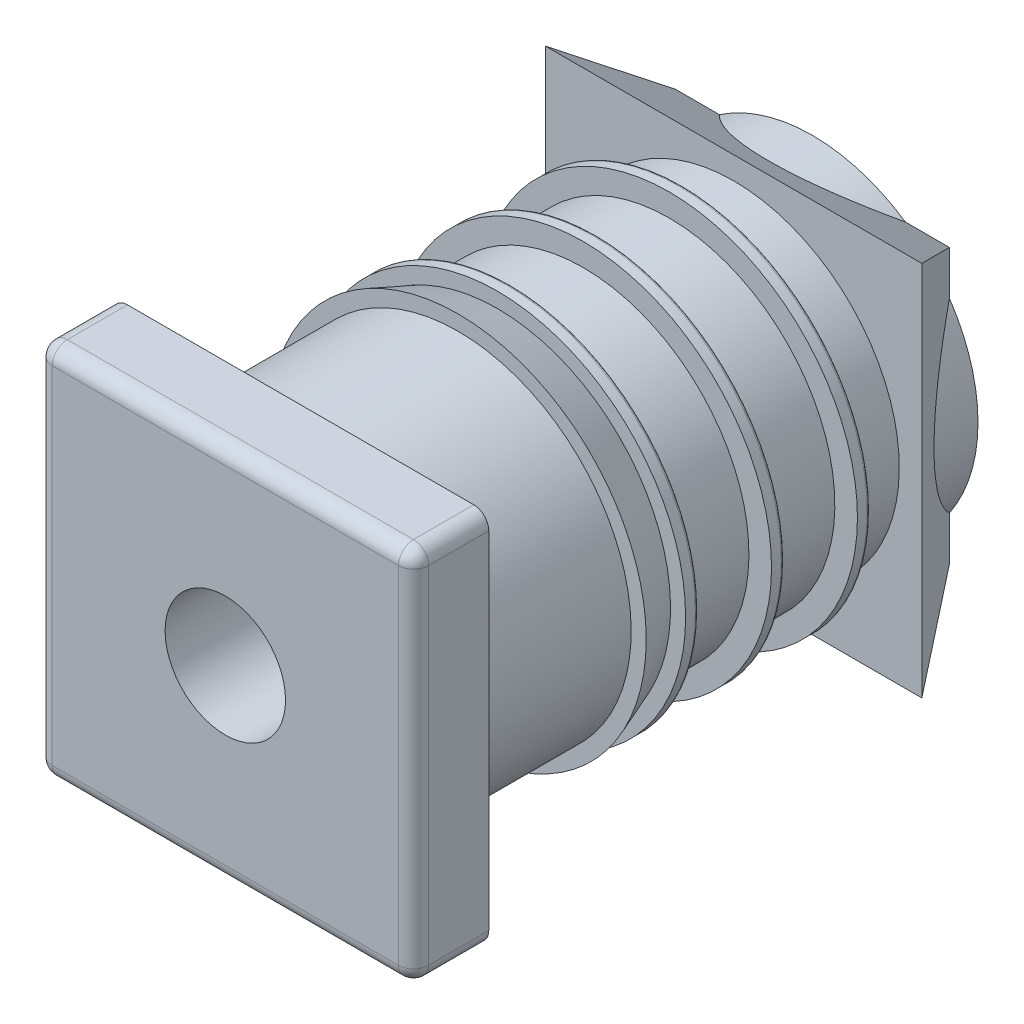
ISO-10303-21;
HEADER;
FILE_DESCRIPTION(('STEP AP214'),'2;1');
FILE_NAME('part.step','',(''),(''),'','','');
FILE_SCHEMA(('AUTOMOTIVE_DESIGN { 1 0 10303 214 1 1 1 1 }'));
ENDSEC;
DATA;
#1=APPLICATION_CONTEXT('core data for automotive mechanical design processes');
#2=APPLICATION_PROTOCOL_DEFINITION('international standard','automotive_design',2000,#1);
#3=PRODUCT_CONTEXT('',#1,'mechanical');
#4=PRODUCT('Part','Part','',(#3));
#5=PRODUCT_RELATED_PRODUCT_CATEGORY('part','',(#4));
#6=PRODUCT_DEFINITION_FORMATION('','',#4);
#7=PRODUCT_DEFINITION_CONTEXT('part definition',#1,'design');
#8=PRODUCT_DEFINITION('design','',#6,#7);
#9=PRODUCT_DEFINITION_SHAPE('','',#8);
#10=(LENGTH_UNIT() NAMED_UNIT(*) SI_UNIT(.MILLI.,.METRE.));
#11=(NAMED_UNIT(*) PLANE_ANGLE_UNIT() SI_UNIT($,.RADIAN.));
#12=(NAMED_UNIT(*) SI_UNIT($,.STERADIAN.) SOLID_ANGLE_UNIT());
#13=UNCERTAINTY_MEASURE_WITH_UNIT(LENGTH_MEASURE(1.E-05),#10,'distance_accuracy_value','');
#14=(GEOMETRIC_REPRESENTATION_CONTEXT(3) GLOBAL_UNCERTAINTY_ASSIGNED_CONTEXT((#13)) GLOBAL_UNIT_ASSIGNED_CONTEXT((#10,
#11,#12)) REPRESENTATION_CONTEXT('',''));
#15=CARTESIAN_POINT('',(0.,0.,0.));
#16=DIRECTION('',(0.,0.,1.));
#17=DIRECTION('',(1.,0.,0.));
#18=AXIS2_PLACEMENT_3D('',#15,#16,#17);
#19=CARTESIAN_POINT('',(-11.65,0.,-19.6340659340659));
#20=DIRECTION('',(0.,0.,-1.));
#21=DIRECTION('',(0.,-1.,0.));
#22=AXIS2_PLACEMENT_3D('',#19,#20,#21);
#23=PLANE('',#22);
#24=CARTESIAN_POINT('',(0.,0.,-19.6340659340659));
#25=DIRECTION('',(0.,0.,1.));
#26=DIRECTION('',(0.,-1.,0.));
#27=AXIS2_PLACEMENT_3D('',#24,#25,#26);
#28=CIRCLE('',#27,12.3);
#29=CARTESIAN_POINT('',(0.,-12.3,-19.6340659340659));
#30=VERTEX_POINT('',#29);
#31=CARTESIAN_POINT('',(0.,12.3,-19.6340659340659));
#32=VERTEX_POINT('',#31);
#33=EDGE_CURVE('E178',#30,#32,#28,.T.);
#34=ORIENTED_EDGE('',*,*,#33,.F.);
#35=CARTESIAN_POINT('',(0.,0.,-19.6340659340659));
#36=DIRECTION('',(0.,0.,1.));
#37=DIRECTION('',(-1.,0.,0.));
#38=AXIS2_PLACEMENT_3D('',#35,#36,#37);
#39=CIRCLE('',#38,12.3);
#40=CARTESIAN_POINT('',(-12.3,0.,-19.6340659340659));
#41=VERTEX_POINT('',#40);
#42=EDGE_CURVE('E171',#41,#30,#39,.T.);
#43=ORIENTED_EDGE('',*,*,#42,.F.);
#44=CARTESIAN_POINT('',(0.,0.,-19.6340659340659));
#45=DIRECTION('',(0.,0.,1.));
#46=DIRECTION('',(0.,1.,0.));
#47=AXIS2_PLACEMENT_3D('',#44,#45,#46);
#48=CIRCLE('',#47,12.3);
#49=EDGE_CURVE('E175',#32,#41,#48,.T.);
#50=ORIENTED_EDGE('',*,*,#49,.F.);
#51=EDGE_LOOP('',(#34,#43,#50));
#52=FACE_BOUND('',#51,.T.);
#53=CARTESIAN_POINT('',(0.,0.,-19.6340659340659));
#54=DIRECTION('',(0.,0.,1.));
#55=DIRECTION('',(0.,1.,0.));
#56=AXIS2_PLACEMENT_3D('',#53,#54,#55);
#57=CIRCLE('',#56,11.);
#58=CARTESIAN_POINT('',(0.,11.,-19.6340659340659));
#59=VERTEX_POINT('',#58);
#60=EDGE_CURVE('E188',#59,#59,#57,.F.);
#61=ORIENTED_EDGE('',*,*,#60,.F.);
#62=EDGE_LOOP('',(#61));
#63=FACE_BOUND('',#62,.T.);
#64=ADVANCED_FACE('F14',(#52,#63),#23,.T.);
#65=CARTESIAN_POINT('',(0.,0.,-22.0626373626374));
#66=DIRECTION('',(0.,0.,1.));
#67=DIRECTION('',(0.,1.,0.));
#68=AXIS2_PLACEMENT_3D('',#65,#66,#67);
#69=CYLINDRICAL_SURFACE('',#68,11.);
#70=CARTESIAN_POINT('',(0.,0.,-24.4912087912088));
#71=DIRECTION('',(0.,0.,1.));
#72=DIRECTION('',(0.,1.,0.));
#73=AXIS2_PLACEMENT_3D('',#70,#71,#72);
#74=CIRCLE('',#73,11.);
#75=CARTESIAN_POINT('',(0.,11.,-24.4912087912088));
#76=VERTEX_POINT('',#75);
#77=EDGE_CURVE('E339',#76,#76,#74,.F.);
#78=ORIENTED_EDGE('',*,*,#77,.F.);
#79=EDGE_LOOP('',(#78));
#80=FACE_BOUND('',#79,.T.);
#81=ORIENTED_EDGE('',*,*,#60,.T.);
#82=EDGE_LOOP('',(#81));
#83=FACE_BOUND('',#82,.T.);
#84=ADVANCED_FACE('F210',(#80,#83),#69,.T.);
#85=CARTESIAN_POINT('',(0.,0.,-19.4340659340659));
#86=DIRECTION('',(0.,0.,-1.));
#87=DIRECTION('',(0.,-1.,0.));
#88=AXIS2_PLACEMENT_3D('',#85,#86,#87);
#89=TOROIDAL_SURFACE('',#88,12.3,0.2);
#90=ORIENTED_EDGE('',*,*,#42,.T.);
#91=ORIENTED_EDGE('',*,*,#33,.T.);
#92=ORIENTED_EDGE('',*,*,#49,.T.);
#93=EDGE_LOOP('',(#90,#91,#92));
#94=FACE_BOUND('',#93,.T.);
#95=CARTESIAN_POINT('',(0.,0.,-19.4340659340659));
#96=DIRECTION('',(0.,0.,1.));
#97=DIRECTION('',(0.,1.,0.));
#98=AXIS2_PLACEMENT_3D('',#95,#96,#97);
#99=CIRCLE('',#98,12.5);
#100=CARTESIAN_POINT('',(0.,12.5,-19.4340659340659));
#101=VERTEX_POINT('',#100);
#102=EDGE_CURVE('E218',#101,#101,#99,.T.);
#103=ORIENTED_EDGE('',*,*,#102,.F.);
#104=EDGE_LOOP('',(#103));
#105=FACE_BOUND('',#104,.T.);
#106=ADVANCED_FACE('F185',(#94,#105),#89,.T.);
#107=CARTESIAN_POINT('',(-11.75,0.,-24.4912087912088));
#108=DIRECTION('',(0.,0.,1.));
#109=DIRECTION('',(0.,1.,0.));
#110=AXIS2_PLACEMENT_3D('',#107,#108,#109);
#111=PLANE('',#110);
#112=ORIENTED_EDGE('',*,*,#77,.T.);
#113=EDGE_LOOP('',(#112));
#114=FACE_BOUND('',#113,.T.);
#115=CARTESIAN_POINT('',(0.,0.,-24.4912087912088));
#116=DIRECTION('',(0.,0.,1.));
#117=DIRECTION('',(0.,1.,0.));
#118=AXIS2_PLACEMENT_3D('',#115,#116,#117);
#119=CIRCLE('',#118,12.5);
#120=CARTESIAN_POINT('',(0.,12.5,-24.4912087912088));
#121=VERTEX_POINT('',#120);
#122=EDGE_CURVE('E336',#121,#121,#119,.F.);
#123=ORIENTED_EDGE('',*,*,#122,.F.);
#124=EDGE_LOOP('',(#123));
#125=FACE_BOUND('',#124,.T.);
#126=ADVANCED_FACE('F209',(#114,#125),#111,.T.);
#127=CARTESIAN_POINT('',(0.,0.,-19.1090659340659));
#128=DIRECTION('',(0.,0.,1.));
#129=DIRECTION('',(0.,1.,0.));
#130=AXIS2_PLACEMENT_3D('',#127,#128,#129);
#131=CYLINDRICAL_SURFACE('',#130,12.5);
#132=ORIENTED_EDGE('',*,*,#102,.T.);
#133=EDGE_LOOP('',(#132));
#134=FACE_BOUND('',#133,.T.);
#135=CARTESIAN_POINT('',(0.,0.,-18.7840659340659));
#136=DIRECTION('',(0.,0.,1.));
#137=DIRECTION('',(0.,1.,0.));
#138=AXIS2_PLACEMENT_3D('',#135,#136,#137);
#139=CIRCLE('',#138,12.5);
#140=CARTESIAN_POINT('',(0.,12.5,-18.7840659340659));
#141=VERTEX_POINT('',#140);
#142=EDGE_CURVE('E333',#141,#141,#139,.T.);
#143=ORIENTED_EDGE('',*,*,#142,.F.);
#144=EDGE_LOOP('',(#143));
#145=FACE_BOUND('',#144,.T.);
#146=ADVANCED_FACE('F482',(#134,#145),#131,.T.);
#147=CARTESIAN_POINT('',(0.,0.,-24.8162087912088));
#148=DIRECTION('',(0.,0.,1.));
#149=DIRECTION('',(0.,1.,0.));
#150=AXIS2_PLACEMENT_3D('',#147,#148,#149);
#151=CYLINDRICAL_SURFACE('',#150,12.5);
#152=ORIENTED_EDGE('',*,*,#122,.T.);
#153=EDGE_LOOP('',(#152));
#154=FACE_BOUND('',#153,.T.);
#155=CARTESIAN_POINT('',(0.,0.,-25.1412087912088));
#156=DIRECTION('',(0.,0.,-1.));
#157=DIRECTION('',(0.,-1.,0.));
#158=AXIS2_PLACEMENT_3D('',#155,#156,#157);
#159=CIRCLE('',#158,12.5);
#160=CARTESIAN_POINT('',(0.,-12.5,-25.1412087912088));
#161=VERTEX_POINT('',#160);
#162=EDGE_CURVE('E332',#161,#161,#159,.T.);
#163=ORIENTED_EDGE('',*,*,#162,.F.);
#164=EDGE_LOOP('',(#163));
#165=FACE_BOUND('',#164,.T.);
#166=ADVANCED_FACE('F480',(#154,#165),#151,.T.);
#167=CARTESIAN_POINT('',(-11.75,0.,-18.7840659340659));
#168=DIRECTION('',(0.,0.,1.));
#169=DIRECTION('',(0.,1.,0.));
#170=AXIS2_PLACEMENT_3D('',#167,#168,#169);
#171=PLANE('',#170);
#172=CARTESIAN_POINT('',(0.,0.,-18.7840659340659));
#173=DIRECTION('',(0.,0.,1.));
#174=DIRECTION('',(0.,1.,0.));
#175=AXIS2_PLACEMENT_3D('',#172,#173,#174);
#176=CIRCLE('',#175,11.);
#177=CARTESIAN_POINT('',(0.,11.,-18.7840659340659));
#178=VERTEX_POINT('',#177);
#179=EDGE_CURVE('E328',#178,#178,#176,.T.);
#180=ORIENTED_EDGE('',*,*,#179,.F.);
#181=EDGE_LOOP('',(#180));
#182=FACE_BOUND('',#181,.T.);
#183=ORIENTED_EDGE('',*,*,#142,.T.);
#184=EDGE_LOOP('',(#183));
#185=FACE_BOUND('',#184,.T.);
#186=ADVANCED_FACE('F460',(#182,#185),#171,.T.);
#187=CARTESIAN_POINT('',(0.,0.,-25.1412087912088));
#188=DIRECTION('',(0.,0.,-1.));
#189=DIRECTION('',(0.,-1.,0.));
#190=AXIS2_PLACEMENT_3D('',#187,#188,#189);
#191=TOROIDAL_SURFACE('',#190,12.3,0.2);
#192=ORIENTED_EDGE('',*,*,#162,.T.);
#193=EDGE_LOOP('',(#192));
#194=FACE_BOUND('',#193,.T.);
#195=CARTESIAN_POINT('',(0.,0.,-25.3412087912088));
#196=DIRECTION('',(0.,0.,1.));
#197=DIRECTION('',(0.,1.,0.));
#198=AXIS2_PLACEMENT_3D('',#195,#196,#197);
#199=CIRCLE('',#198,12.3);
#200=CARTESIAN_POINT('',(-12.3,0.,-25.3412087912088));
#201=VERTEX_POINT('',#200);
#202=CARTESIAN_POINT('',(0.,12.3,-25.3412087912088));
#203=VERTEX_POINT('',#202);
#204=EDGE_CURVE('E331',#201,#203,#199,.F.);
#205=ORIENTED_EDGE('',*,*,#204,.F.);
#206=CARTESIAN_POINT('',(0.,0.,-25.3412087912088));
#207=DIRECTION('',(0.,0.,1.));
#208=DIRECTION('',(-1.,0.,0.));
#209=AXIS2_PLACEMENT_3D('',#206,#207,#208);
#210=CIRCLE('',#209,12.3);
#211=CARTESIAN_POINT('',(0.,-12.3,-25.3412087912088));
#212=VERTEX_POINT('',#211);
#213=EDGE_CURVE('E327',#212,#201,#210,.F.);
#214=ORIENTED_EDGE('',*,*,#213,.F.);
#215=CARTESIAN_POINT('',(0.,0.,-25.3412087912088));
#216=DIRECTION('',(0.,0.,1.));
#217=DIRECTION('',(0.,-1.,0.));
#218=AXIS2_PLACEMENT_3D('',#215,#216,#217);
#219=CIRCLE('',#218,12.3);
#220=EDGE_CURVE('E434',#203,#212,#219,.F.);
#221=ORIENTED_EDGE('',*,*,#220,.F.);
#222=EDGE_LOOP('',(#205,#214,#221));
#223=FACE_BOUND('',#222,.T.);
#224=ADVANCED_FACE('F455',(#194,#223),#191,.T.);
#225=CARTESIAN_POINT('',(0.,0.,-16.3554945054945));
#226=DIRECTION('',(0.,0.,1.));
#227=DIRECTION('',(0.,1.,0.));
#228=AXIS2_PLACEMENT_3D('',#225,#226,#227);
#229=CYLINDRICAL_SURFACE('',#228,11.);
#230=ORIENTED_EDGE('',*,*,#179,.T.);
#231=EDGE_LOOP('',(#230));
#232=FACE_BOUND('',#231,.T.);
#233=CARTESIAN_POINT('',(0.,0.,-13.9269230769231));
#234=DIRECTION('',(0.,0.,1.));
#235=DIRECTION('',(0.,1.,0.));
#236=AXIS2_PLACEMENT_3D('',#233,#234,#235);
#237=CIRCLE('',#236,11.);
#238=CARTESIAN_POINT('',(0.,11.,-13.9269230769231));
#239=VERTEX_POINT('',#238);
#240=EDGE_CURVE('E324',#239,#239,#237,.T.);
#241=ORIENTED_EDGE('',*,*,#240,.F.);
#242=EDGE_LOOP('',(#241));
#243=FACE_BOUND('',#242,.T.);
#244=ADVANCED_FACE('F459',(#232,#243),#229,.T.);
#245=CARTESIAN_POINT('',(-11.65,0.,-25.3412087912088));
#246=DIRECTION('',(0.,0.,-1.));
#247=DIRECTION('',(0.,-1.,0.));
#248=AXIS2_PLACEMENT_3D('',#245,#246,#247);
#249=PLANE('',#248);
#250=ORIENTED_EDGE('',*,*,#220,.T.);
#251=ORIENTED_EDGE('',*,*,#213,.T.);
#252=ORIENTED_EDGE('',*,*,#204,.T.);
#253=EDGE_LOOP('',(#250,#251,#252));
#254=FACE_BOUND('',#253,.T.);
#255=CARTESIAN_POINT('',(0.,0.,-25.3412087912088));
#256=DIRECTION('',(0.,0.,1.));
#257=DIRECTION('',(0.,1.,0.));
#258=AXIS2_PLACEMENT_3D('',#255,#256,#257);
#259=CIRCLE('',#258,11.);
#260=CARTESIAN_POINT('',(0.,11.,-25.3412087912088));
#261=VERTEX_POINT('',#260);
#262=EDGE_CURVE('E320',#261,#261,#259,.F.);
#263=ORIENTED_EDGE('',*,*,#262,.F.);
#264=EDGE_LOOP('',(#263));
#265=FACE_BOUND('',#264,.T.);
#266=ADVANCED_FACE('F392',(#254,#265),#249,.T.);
#267=CARTESIAN_POINT('',(-11.65,0.,-13.9269230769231));
#268=DIRECTION('',(0.,0.,-1.));
#269=DIRECTION('',(0.,-1.,0.));
#270=AXIS2_PLACEMENT_3D('',#267,#268,#269);
#271=PLANE('',#270);
#272=CARTESIAN_POINT('',(0.,0.,-13.9269230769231));
#273=DIRECTION('',(0.,0.,1.));
#274=DIRECTION('',(0.,-1.,0.));
#275=AXIS2_PLACEMENT_3D('',#272,#273,#274);
#276=CIRCLE('',#275,12.3);
#277=CARTESIAN_POINT('',(0.,-12.3,-13.9269230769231));
#278=VERTEX_POINT('',#277);
#279=CARTESIAN_POINT('',(0.,12.3,-13.9269230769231));
#280=VERTEX_POINT('',#279);
#281=EDGE_CURVE('E319',#278,#280,#276,.T.);
#282=ORIENTED_EDGE('',*,*,#281,.F.);
#283=CARTESIAN_POINT('',(0.,0.,-13.9269230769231));
#284=DIRECTION('',(0.,0.,1.));
#285=DIRECTION('',(-1.,0.,0.));
#286=AXIS2_PLACEMENT_3D('',#283,#284,#285);
#287=CIRCLE('',#286,12.3);
#288=CARTESIAN_POINT('',(-12.3,0.,-13.9269230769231));
#289=VERTEX_POINT('',#288);
#290=EDGE_CURVE('E409',#289,#278,#287,.T.);
#291=ORIENTED_EDGE('',*,*,#290,.F.);
#292=CARTESIAN_POINT('',(0.,0.,-13.9269230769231));
#293=DIRECTION('',(0.,0.,1.));
#294=DIRECTION('',(0.,1.,0.));
#295=AXIS2_PLACEMENT_3D('',#292,#293,#294);
#296=CIRCLE('',#295,12.3);
#297=EDGE_CURVE('E323',#280,#289,#296,.T.);
#298=ORIENTED_EDGE('',*,*,#297,.F.);
#299=EDGE_LOOP('',(#282,#291,#298));
#300=FACE_BOUND('',#299,.T.);
#301=ORIENTED_EDGE('',*,*,#240,.T.);
#302=EDGE_LOOP('',(#301));
#303=FACE_BOUND('',#302,.T.);
#304=ADVANCED_FACE('F383',(#300,#303),#271,.T.);
#305=CARTESIAN_POINT('',(0.,0.,-29.6706043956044));
#306=DIRECTION('',(0.,0.,1.));
#307=DIRECTION('',(0.,1.,0.));
#308=AXIS2_PLACEMENT_3D('',#305,#306,#307);
#309=CYLINDRICAL_SURFACE('',#308,11.);
#310=ORIENTED_EDGE('',*,*,#262,.T.);
#311=EDGE_LOOP('',(#310));
#312=FACE_BOUND('',#311,.T.);
#313=CARTESIAN_POINT('',(0.,0.,-28.7692307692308));
#314=DIRECTION('',(0.,0.,1.));
#315=DIRECTION('',(0.,1.,0.));
#316=AXIS2_PLACEMENT_3D('',#313,#314,#315);
#317=CIRCLE('',#316,11.);
#318=CARTESIAN_POINT('',(0.,11.,-28.7692307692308));
#319=VERTEX_POINT('',#318);
#320=EDGE_CURVE('E315',#319,#319,#317,.F.);
#321=ORIENTED_EDGE('',*,*,#320,.F.);
#322=EDGE_LOOP('',(#321));
#323=FACE_BOUND('',#322,.T.);
#324=ADVANCED_FACE('F366',(#312,#323),#309,.T.);
#325=CARTESIAN_POINT('',(0.,0.,-13.7269230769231));
#326=DIRECTION('',(0.,0.,-1.));
#327=DIRECTION('',(0.,-1.,0.));
#328=AXIS2_PLACEMENT_3D('',#325,#326,#327);
#329=TOROIDAL_SURFACE('',#328,12.3,0.2);
#330=ORIENTED_EDGE('',*,*,#290,.T.);
#331=ORIENTED_EDGE('',*,*,#281,.T.);
#332=ORIENTED_EDGE('',*,*,#297,.T.);
#333=EDGE_LOOP('',(#330,#331,#332));
#334=FACE_BOUND('',#333,.T.);
#335=CARTESIAN_POINT('',(0.,0.,-13.7269230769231));
#336=DIRECTION('',(0.,0.,1.));
#337=DIRECTION('',(0.,1.,0.));
#338=AXIS2_PLACEMENT_3D('',#335,#336,#337);
#339=CIRCLE('',#338,12.5);
#340=CARTESIAN_POINT('',(0.,12.5,-13.7269230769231));
#341=VERTEX_POINT('',#340);
#342=EDGE_CURVE('E318',#341,#341,#339,.T.);
#343=ORIENTED_EDGE('',*,*,#342,.F.);
#344=EDGE_LOOP('',(#343));
#345=FACE_BOUND('',#344,.T.);
#346=ADVANCED_FACE('F354',(#334,#345),#329,.T.);
#347=CARTESIAN_POINT('',(12.5,-12.5,-28.7692307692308));
#348=DIRECTION('',(0.,0.,1.));
#349=DIRECTION('',(0.,1.,0.));
#350=AXIS2_PLACEMENT_3D('',#347,#348,#349);
#351=PLANE('',#350);
#352=DIRECTION('',(-1.,0.,0.));
#353=VECTOR('',#352,1.);
#354=CARTESIAN_POINT('',(-12.5,-12.5,-28.7692307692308));
#355=LINE('',#354,#353);
#356=CARTESIAN_POINT('',(-12.5,-12.5,-28.7692307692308));
#357=VERTEX_POINT('',#356);
#358=CARTESIAN_POINT('',(12.5,-12.5,-28.7692307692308));
#359=VERTEX_POINT('',#358);
#360=EDGE_CURVE('E314',#357,#359,#355,.F.);
#361=ORIENTED_EDGE('',*,*,#360,.T.);
#362=DIRECTION('',(0.,-1.,0.));
#363=VECTOR('',#362,1.);
#364=CARTESIAN_POINT('',(12.5,-12.5,-28.7692307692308));
#365=LINE('',#364,#363);
#366=CARTESIAN_POINT('',(12.5,12.5,-28.7692307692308));
#367=VERTEX_POINT('',#366);
#368=EDGE_CURVE('E621',#367,#359,#365,.T.);
#369=ORIENTED_EDGE('',*,*,#368,.F.);
#370=DIRECTION('',(-1.,0.,0.));
#371=VECTOR('',#370,1.);
#372=CARTESIAN_POINT('',(-12.5,12.5,-28.7692307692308));
#373=LINE('',#372,#371);
#374=CARTESIAN_POINT('',(-12.5,12.5,-28.7692307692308));
#375=VERTEX_POINT('',#374);
#376=EDGE_CURVE('E623',#367,#375,#373,.T.);
#377=ORIENTED_EDGE('',*,*,#376,.T.);
#378=DIRECTION('',(0.,-1.,0.));
#379=VECTOR('',#378,1.);
#380=CARTESIAN_POINT('',(-12.5,-12.5,-28.7692307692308));
#381=LINE('',#380,#379);
#382=EDGE_CURVE('E624',#357,#375,#381,.F.);
#383=ORIENTED_EDGE('',*,*,#382,.F.);
#384=EDGE_LOOP('',(#361,#369,#377,#383));
#385=FACE_BOUND('',#384,.T.);
#386=ORIENTED_EDGE('',*,*,#320,.T.);
#387=EDGE_LOOP('',(#386));
#388=FACE_BOUND('',#387,.T.);
#389=ADVANCED_FACE('F365',(#385,#388),#351,.T.);
#390=CARTESIAN_POINT('',(0.,0.,-13.4019230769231));
#391=DIRECTION('',(0.,0.,1.));
#392=DIRECTION('',(0.,1.,0.));
#393=AXIS2_PLACEMENT_3D('',#390,#391,#392);
#394=CYLINDRICAL_SURFACE('',#393,12.5);
#395=ORIENTED_EDGE('',*,*,#342,.T.);
#396=EDGE_LOOP('',(#395));
#397=FACE_BOUND('',#396,.T.);
#398=CARTESIAN_POINT('',(0.,0.,-13.0769230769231));
#399=DIRECTION('',(0.,0.,1.));
#400=DIRECTION('',(0.,1.,0.));
#401=AXIS2_PLACEMENT_3D('',#398,#399,#400);
#402=CIRCLE('',#401,12.5);
#403=CARTESIAN_POINT('',(0.,12.5,-13.0769230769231));
#404=VERTEX_POINT('',#403);
#405=EDGE_CURVE('E298',#404,#404,#402,.T.);
#406=ORIENTED_EDGE('',*,*,#405,.F.);
#407=EDGE_LOOP('',(#406));
#408=FACE_BOUND('',#407,.T.);
#409=ADVANCED_FACE('F602',(#397,#408),#394,.T.);
#410=CARTESIAN_POINT('',(0.,0.,-29.6706043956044));
#411=DIRECTION('',(0.,0.,1.));
#412=DIRECTION('',(0.,1.,0.));
#413=AXIS2_PLACEMENT_3D('',#410,#411,#412);
#414=CYLINDRICAL_SURFACE('',#413,11.);
#415=CARTESIAN_POINT('',(0.,0.,-48.0175428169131));
#416=DIRECTION('',(0.,0.838670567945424,0.544639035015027));
#417=DIRECTION('',(0.,-0.544639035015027,0.838670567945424));
#418=AXIS2_PLACEMENT_3D('',#415,#416,#417);
#419=ELLIPSE('',#418,20.1968630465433,11.);
#420=CARTESIAN_POINT('',(6.17524034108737,-9.10309874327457,-34.));
#421=VERTEX_POINT('',#420);
#422=CARTESIAN_POINT('',(-6.17524034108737,-9.10309874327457,-34.));
#423=VERTEX_POINT('',#422);
#424=EDGE_CURVE('E120',#421,#423,#419,.F.);
#425=ORIENTED_EDGE('',*,*,#424,.T.);
#426=CARTESIAN_POINT('',(0.,0.,-34.));
#427=DIRECTION('',(0.,0.,1.));
#428=DIRECTION('',(0.,1.,0.));
#429=AXIS2_PLACEMENT_3D('',#426,#427,#428);
#430=CIRCLE('',#429,11.);
#431=EDGE_CURVE('E293',#421,#423,#430,.F.);
#432=ORIENTED_EDGE('',*,*,#431,.F.);
#433=EDGE_LOOP('',(#425,#432));
#434=FACE_BOUND('',#433,.T.);
#435=ADVANCED_FACE('F600',(#434),#414,.T.);
#436=CARTESIAN_POINT('',(-12.5,-12.5,-28.7692307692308));
#437=DIRECTION('',(0.,0.838670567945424,0.544639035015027));
#438=DIRECTION('',(0.,0.544639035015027,-0.838670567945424));
#439=AXIS2_PLACEMENT_3D('',#436,#437,#438);
#440=PLANE('',#439);
#441=DIRECTION('',(-1.,0.,0.));
#442=VECTOR('',#441,1.);
#443=CARTESIAN_POINT('',(-9.10309874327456,-9.10309874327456,-34.));
#444=LINE('',#443,#442);
#445=CARTESIAN_POINT('',(9.10309874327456,-9.10309874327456,-34.));
#446=VERTEX_POINT('',#445);
#447=EDGE_CURVE('E297',#446,#421,#444,.T.);
#448=ORIENTED_EDGE('',*,*,#447,.F.);
#449=DIRECTION('',(-0.478300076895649,0.478300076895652,-0.736517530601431));
#450=VECTOR('',#449,1.);
#451=CARTESIAN_POINT('',(12.5,-12.5,-28.7692307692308));
#452=LINE('',#451,#450);
#453=EDGE_CURVE('E127',#359,#446,#452,.T.);
#454=ORIENTED_EDGE('',*,*,#453,.F.);
#455=ORIENTED_EDGE('',*,*,#360,.F.);
#456=DIRECTION('',(-0.478300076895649,-0.478300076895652,0.736517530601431));
#457=VECTOR('',#456,1.);
#458=CARTESIAN_POINT('',(-9.10309874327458,-9.10309874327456,-34.));
#459=LINE('',#458,#457);
#460=CARTESIAN_POINT('',(-9.10309874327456,-9.10309874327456,-34.));
#461=VERTEX_POINT('',#460);
#462=EDGE_CURVE('E312',#461,#357,#459,.T.);
#463=ORIENTED_EDGE('',*,*,#462,.F.);
#464=DIRECTION('',(-1.,0.,0.));
#465=VECTOR('',#464,1.);
#466=CARTESIAN_POINT('',(-9.10309874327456,-9.10309874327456,-34.));
#467=LINE('',#466,#465);
#468=EDGE_CURVE('E296',#423,#461,#467,.T.);
#469=ORIENTED_EDGE('',*,*,#468,.F.);
#470=ORIENTED_EDGE('',*,*,#424,.F.);
#471=EDGE_LOOP('',(#448,#454,#455,#463,#469,#470));
#472=FACE_BOUND('',#471,.T.);
#473=ADVANCED_FACE('F596',(#472),#440,.F.);
#474=CARTESIAN_POINT('',(0.,0.,-29.6706043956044));
#475=DIRECTION('',(0.,0.,1.));
#476=DIRECTION('',(0.,1.,0.));
#477=AXIS2_PLACEMENT_3D('',#474,#475,#476);
#478=CYLINDRICAL_SURFACE('',#477,11.);
#479=CARTESIAN_POINT('',(0.,0.,-48.0175428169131));
#480=DIRECTION('',(-0.838670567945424,0.,-0.544639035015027));
#481=DIRECTION('',(-0.544639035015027,0.,0.838670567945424));
#482=AXIS2_PLACEMENT_3D('',#479,#480,#481);
#483=ELLIPSE('',#482,20.1968630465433,11.);
#484=CARTESIAN_POINT('',(-9.10309874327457,6.17524034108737,-34.));
#485=VERTEX_POINT('',#484);
#486=CARTESIAN_POINT('',(-9.10309874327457,-6.17524034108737,-34.));
#487=VERTEX_POINT('',#486);
#488=EDGE_CURVE('E309',#485,#487,#483,.F.);
#489=ORIENTED_EDGE('',*,*,#488,.F.);
#490=CARTESIAN_POINT('',(0.,0.,-34.));
#491=DIRECTION('',(0.,0.,1.));
#492=DIRECTION('',(0.,1.,0.));
#493=AXIS2_PLACEMENT_3D('',#490,#491,#492);
#494=CIRCLE('',#493,11.);
#495=EDGE_CURVE('E288',#487,#485,#494,.F.);
#496=ORIENTED_EDGE('',*,*,#495,.F.);
#497=EDGE_LOOP('',(#489,#496));
#498=FACE_BOUND('',#497,.T.);
#499=ADVANCED_FACE('F592',(#498),#478,.T.);
#500=CARTESIAN_POINT('',(-12.5,-12.5,-28.7692307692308));
#501=DIRECTION('',(-0.838670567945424,0.,-0.544639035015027));
#502=DIRECTION('',(0.544639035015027,0.,-0.838670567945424));
#503=AXIS2_PLACEMENT_3D('',#500,#501,#502);
#504=PLANE('',#503);
#505=DIRECTION('',(0.478300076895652,-0.478300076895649,-0.736517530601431));
#506=VECTOR('',#505,1.);
#507=CARTESIAN_POINT('',(-12.5,12.5,-28.7692307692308));
#508=LINE('',#507,#506);
#509=CARTESIAN_POINT('',(-9.10309874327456,9.10309874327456,-34.));
#510=VERTEX_POINT('',#509);
#511=EDGE_CURVE('E308',#375,#510,#508,.T.);
#512=ORIENTED_EDGE('',*,*,#511,.T.);
#513=DIRECTION('',(0.,-1.,0.));
#514=VECTOR('',#513,1.);
#515=CARTESIAN_POINT('',(-9.10309874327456,-12.5,-34.));
#516=LINE('',#515,#514);
#517=EDGE_CURVE('E291',#485,#510,#516,.F.);
#518=ORIENTED_EDGE('',*,*,#517,.F.);
#519=ORIENTED_EDGE('',*,*,#488,.T.);
#520=DIRECTION('',(0.,-1.,0.));
#521=VECTOR('',#520,1.);
#522=CARTESIAN_POINT('',(-9.10309874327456,-12.5,-34.));
#523=LINE('',#522,#521);
#524=EDGE_CURVE('E292',#461,#487,#523,.F.);
#525=ORIENTED_EDGE('',*,*,#524,.F.);
#526=ORIENTED_EDGE('',*,*,#462,.T.);
#527=ORIENTED_EDGE('',*,*,#382,.T.);
#528=EDGE_LOOP('',(#512,#518,#519,#525,#526,#527));
#529=FACE_BOUND('',#528,.T.);
#530=ADVANCED_FACE('F588',(#529),#504,.T.);
#531=CARTESIAN_POINT('',(0.,0.,-29.6706043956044));
#532=DIRECTION('',(0.,0.,1.));
#533=DIRECTION('',(0.,1.,0.));
#534=AXIS2_PLACEMENT_3D('',#531,#532,#533);
#535=CYLINDRICAL_SURFACE('',#534,11.);
#536=CARTESIAN_POINT('',(0.,0.,-48.0175428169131));
#537=DIRECTION('',(0.,-0.838670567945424,0.544639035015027));
#538=DIRECTION('',(0.,0.544639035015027,0.838670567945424));
#539=AXIS2_PLACEMENT_3D('',#536,#537,#538);
#540=ELLIPSE('',#539,20.1968630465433,11.);
#541=CARTESIAN_POINT('',(-6.17524034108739,9.10309874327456,-34.));
#542=VERTEX_POINT('',#541);
#543=CARTESIAN_POINT('',(6.17524034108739,9.10309874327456,-34.));
#544=VERTEX_POINT('',#543);
#545=EDGE_CURVE('E305',#542,#544,#540,.F.);
#546=ORIENTED_EDGE('',*,*,#545,.T.);
#547=CARTESIAN_POINT('',(0.,0.,-34.));
#548=DIRECTION('',(0.,0.,1.));
#549=DIRECTION('',(0.,1.,0.));
#550=AXIS2_PLACEMENT_3D('',#547,#548,#549);
#551=CIRCLE('',#550,11.);
#552=EDGE_CURVE('E283',#542,#544,#551,.F.);
#553=ORIENTED_EDGE('',*,*,#552,.F.);
#554=EDGE_LOOP('',(#546,#553));
#555=FACE_BOUND('',#554,.T.);
#556=ADVANCED_FACE('F584',(#555),#535,.T.);
#557=CARTESIAN_POINT('',(-12.5,9.10309874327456,-34.));
#558=DIRECTION('',(0.,-0.838670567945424,0.544639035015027));
#559=DIRECTION('',(0.,0.544639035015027,0.838670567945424));
#560=AXIS2_PLACEMENT_3D('',#557,#558,#559);
#561=PLANE('',#560);
#562=DIRECTION('',(-1.,0.,0.));
#563=VECTOR('',#562,1.);
#564=CARTESIAN_POINT('',(-9.10309874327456,9.10309874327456,-34.));
#565=LINE('',#564,#563);
#566=EDGE_CURVE('E287',#510,#542,#565,.F.);
#567=ORIENTED_EDGE('',*,*,#566,.F.);
#568=ORIENTED_EDGE('',*,*,#511,.F.);
#569=ORIENTED_EDGE('',*,*,#376,.F.);
#570=DIRECTION('',(0.478300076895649,0.478300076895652,0.736517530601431));
#571=VECTOR('',#570,1.);
#572=CARTESIAN_POINT('',(9.10309874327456,9.10309874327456,-34.));
#573=LINE('',#572,#571);
#574=CARTESIAN_POINT('',(9.10309874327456,9.10309874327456,-34.));
#575=VERTEX_POINT('',#574);
#576=EDGE_CURVE('E307',#575,#367,#573,.T.);
#577=ORIENTED_EDGE('',*,*,#576,.F.);
#578=DIRECTION('',(-1.,0.,0.));
#579=VECTOR('',#578,1.);
#580=CARTESIAN_POINT('',(-9.10309874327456,9.10309874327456,-34.));
#581=LINE('',#580,#579);
#582=EDGE_CURVE('E286',#544,#575,#581,.F.);
#583=ORIENTED_EDGE('',*,*,#582,.F.);
#584=ORIENTED_EDGE('',*,*,#545,.F.);
#585=EDGE_LOOP('',(#567,#568,#569,#577,#583,#584));
#586=FACE_BOUND('',#585,.T.);
#587=ADVANCED_FACE('F581',(#586),#561,.F.);
#588=CARTESIAN_POINT('',(9.10309874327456,-12.5,-34.));
#589=DIRECTION('',(0.838670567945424,0.,-0.544639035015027));
#590=DIRECTION('',(0.544639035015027,0.,0.838670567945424));
#591=AXIS2_PLACEMENT_3D('',#588,#589,#590);
#592=PLANE('',#591);
#593=ORIENTED_EDGE('',*,*,#453,.T.);
#594=DIRECTION('',(0.,-1.,0.));
#595=VECTOR('',#594,1.);
#596=CARTESIAN_POINT('',(9.10309874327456,-12.5,-34.));
#597=LINE('',#596,#595);
#598=CARTESIAN_POINT('',(9.10309874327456,-6.17524034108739,-34.));
#599=VERTEX_POINT('',#598);
#600=EDGE_CURVE('E301',#599,#446,#597,.T.);
#601=ORIENTED_EDGE('',*,*,#600,.F.);
#602=CARTESIAN_POINT('',(0.,0.,-48.0175428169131));
#603=DIRECTION('',(0.838670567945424,0.,-0.544639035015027));
#604=DIRECTION('',(0.544639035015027,0.,0.838670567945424));
#605=AXIS2_PLACEMENT_3D('',#602,#603,#604);
#606=ELLIPSE('',#605,20.1968630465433,11.);
#607=CARTESIAN_POINT('',(9.10309874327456,6.17524034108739,-34.));
#608=VERTEX_POINT('',#607);
#609=EDGE_CURVE('E302',#608,#599,#606,.T.);
#610=ORIENTED_EDGE('',*,*,#609,.F.);
#611=DIRECTION('',(0.,-1.,0.));
#612=VECTOR('',#611,1.);
#613=CARTESIAN_POINT('',(9.10309874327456,-12.5,-34.));
#614=LINE('',#613,#612);
#615=EDGE_CURVE('E282',#575,#608,#614,.T.);
#616=ORIENTED_EDGE('',*,*,#615,.F.);
#617=ORIENTED_EDGE('',*,*,#576,.T.);
#618=ORIENTED_EDGE('',*,*,#368,.T.);
#619=EDGE_LOOP('',(#593,#601,#610,#616,#617,#618));
#620=FACE_BOUND('',#619,.T.);
#621=ADVANCED_FACE('F577',(#620),#592,.T.);
#622=CARTESIAN_POINT('',(0.,0.,-29.6706043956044));
#623=DIRECTION('',(0.,0.,1.));
#624=DIRECTION('',(0.,1.,0.));
#625=AXIS2_PLACEMENT_3D('',#622,#623,#624);
#626=CYLINDRICAL_SURFACE('',#625,11.);
#627=ORIENTED_EDGE('',*,*,#609,.T.);
#628=CARTESIAN_POINT('',(0.,0.,-34.));
#629=DIRECTION('',(0.,0.,1.));
#630=DIRECTION('',(0.,1.,0.));
#631=AXIS2_PLACEMENT_3D('',#628,#629,#630);
#632=CIRCLE('',#631,11.);
#633=EDGE_CURVE('E279',#608,#599,#632,.F.);
#634=ORIENTED_EDGE('',*,*,#633,.F.);
#635=EDGE_LOOP('',(#627,#634));
#636=FACE_BOUND('',#635,.T.);
#637=ADVANCED_FACE('F573',(#636),#626,.T.);
#638=CARTESIAN_POINT('',(-12.,0.,-13.0769230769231));
#639=DIRECTION('',(0.,0.,1.));
#640=DIRECTION('',(0.,1.,0.));
#641=AXIS2_PLACEMENT_3D('',#638,#639,#640);
#642=PLANE('',#641);
#643=CARTESIAN_POINT('',(0.,0.,-13.0769230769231));
#644=DIRECTION('',(0.,0.,1.));
#645=DIRECTION('',(0.,1.,0.));
#646=AXIS2_PLACEMENT_3D('',#643,#644,#645);
#647=CIRCLE('',#646,11.5);
#648=CARTESIAN_POINT('',(0.,11.5,-13.0769230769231));
#649=VERTEX_POINT('',#648);
#650=EDGE_CURVE('E276',#649,#649,#647,.T.);
#651=ORIENTED_EDGE('',*,*,#650,.F.);
#652=EDGE_LOOP('',(#651));
#653=FACE_BOUND('',#652,.T.);
#654=ORIENTED_EDGE('',*,*,#405,.T.);
#655=EDGE_LOOP('',(#654));
#656=FACE_BOUND('',#655,.T.);
#657=ADVANCED_FACE('F569',(#653,#656),#642,.T.);
#658=CARTESIAN_POINT('',(-9.10309874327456,-12.5,-34.));
#659=DIRECTION('',(0.,0.,-1.));
#660=DIRECTION('',(0.,-1.,0.));
#661=AXIS2_PLACEMENT_3D('',#658,#659,#660);
#662=PLANE('',#661);
#663=ORIENTED_EDGE('',*,*,#615,.T.);
#664=ORIENTED_EDGE('',*,*,#633,.T.);
#665=ORIENTED_EDGE('',*,*,#600,.T.);
#666=ORIENTED_EDGE('',*,*,#447,.T.);
#667=ORIENTED_EDGE('',*,*,#431,.T.);
#668=ORIENTED_EDGE('',*,*,#468,.T.);
#669=ORIENTED_EDGE('',*,*,#524,.T.);
#670=ORIENTED_EDGE('',*,*,#495,.T.);
#671=ORIENTED_EDGE('',*,*,#517,.T.);
#672=ORIENTED_EDGE('',*,*,#566,.T.);
#673=ORIENTED_EDGE('',*,*,#552,.T.);
#674=ORIENTED_EDGE('',*,*,#582,.T.);
#675=EDGE_LOOP('',(#663,#664,#665,#666,#667,#668,#669,#670,#671,#672,#673,#674));
#676=FACE_BOUND('',#675,.T.);
#677=CARTESIAN_POINT('',(0.,0.,-34.));
#678=DIRECTION('',(0.,0.,-1.));
#679=DIRECTION('',(0.,-1.,0.));
#680=AXIS2_PLACEMENT_3D('',#677,#678,#679);
#681=CIRCLE('',#680,4.);
#682=CARTESIAN_POINT('',(0.,-4.,-34.));
#683=VERTEX_POINT('',#682);
#684=EDGE_CURVE('E709',#683,#683,#681,.T.);
#685=ORIENTED_EDGE('',*,*,#684,.F.);
#686=EDGE_LOOP('',(#685));
#687=FACE_BOUND('',#686,.T.);
#688=ADVANCED_FACE('F565',(#676,#687),#662,.T.);
#689=CARTESIAN_POINT('',(0.,0.,-10.4615384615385));
#690=DIRECTION('',(0.,0.,1.));
#691=DIRECTION('',(0.,1.,0.));
#692=AXIS2_PLACEMENT_3D('',#689,#690,#691);
#693=CONICAL_SURFACE('',#692,12.5,0.365201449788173);
#694=ORIENTED_EDGE('',*,*,#650,.T.);
#695=EDGE_LOOP('',(#694));
#696=FACE_BOUND('',#695,.T.);
#697=CARTESIAN_POINT('',(0.,0.,-10.4615384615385));
#698=DIRECTION('',(0.,0.,1.));
#699=DIRECTION('',(0.,1.,0.));
#700=AXIS2_PLACEMENT_3D('',#697,#698,#699);
#701=CIRCLE('',#700,12.5);
#702=CARTESIAN_POINT('',(0.,12.5,-10.4615384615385));
#703=VERTEX_POINT('',#702);
#704=EDGE_CURVE('E273',#703,#703,#701,.T.);
#705=ORIENTED_EDGE('',*,*,#704,.F.);
#706=EDGE_LOOP('',(#705));
#707=FACE_BOUND('',#706,.T.);
#708=ADVANCED_FACE('F561',(#696,#707),#693,.T.);
#709=CARTESIAN_POINT('',(-12.,0.,-10.4615384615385));
#710=DIRECTION('',(0.,0.,1.));
#711=DIRECTION('',(0.,1.,0.));
#712=AXIS2_PLACEMENT_3D('',#709,#710,#711);
#713=PLANE('',#712);
#714=CARTESIAN_POINT('',(0.,0.,-10.4615384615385));
#715=DIRECTION('',(0.,0.,1.));
#716=DIRECTION('',(0.,1.,0.));
#717=AXIS2_PLACEMENT_3D('',#714,#715,#716);
#718=CIRCLE('',#717,11.5);
#719=CARTESIAN_POINT('',(0.,11.5,-10.4615384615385));
#720=VERTEX_POINT('',#719);
#721=EDGE_CURVE('E270',#720,#720,#718,.T.);
#722=ORIENTED_EDGE('',*,*,#721,.F.);
#723=EDGE_LOOP('',(#722));
#724=FACE_BOUND('',#723,.T.);
#725=ORIENTED_EDGE('',*,*,#704,.T.);
#726=EDGE_LOOP('',(#725));
#727=FACE_BOUND('',#726,.T.);
#728=ADVANCED_FACE('F557',(#724,#727),#713,.T.);
#729=CARTESIAN_POINT('',(0.,0.,-2.73076923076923));
#730=DIRECTION('',(0.,0.,1.));
#731=DIRECTION('',(0.,1.,0.));
#732=AXIS2_PLACEMENT_3D('',#729,#730,#731);
#733=CYLINDRICAL_SURFACE('',#732,11.5);
#734=CARTESIAN_POINT('',(0.,0.,0.));
#735=DIRECTION('',(0.,0.,1.));
#736=DIRECTION('',(0.,1.,0.));
#737=AXIS2_PLACEMENT_3D('',#734,#735,#736);
#738=CIRCLE('',#737,11.5);
#739=CARTESIAN_POINT('',(0.,11.5,0.));
#740=VERTEX_POINT('',#739);
#741=EDGE_CURVE('E261',#740,#740,#738,.T.);
#742=ORIENTED_EDGE('',*,*,#741,.F.);
#743=EDGE_LOOP('',(#742));
#744=FACE_BOUND('',#743,.T.);
#745=ORIENTED_EDGE('',*,*,#721,.T.);
#746=EDGE_LOOP('',(#745));
#747=FACE_BOUND('',#746,.T.);
#748=ADVANCED_FACE('F553',(#744,#747),#733,.T.);
#749=CARTESIAN_POINT('',(11.5,-11.5,5.));
#750=DIRECTION('',(0.,0.,1.));
#751=DIRECTION('',(0.,1.,0.));
#752=AXIS2_PLACEMENT_3D('',#749,#750,#751);
#753=CYLINDRICAL_SURFACE('',#752,1.);
#754=DIRECTION('',(0.,0.,-1.));
#755=VECTOR('',#754,1.);
#756=CARTESIAN_POINT('',(12.5,-11.5,5.));
#757=LINE('',#756,#755);
#758=CARTESIAN_POINT('',(12.5,-11.5,4.));
#759=VERTEX_POINT('',#758);
#760=CARTESIAN_POINT('',(12.5,-11.5,0.));
#761=VERTEX_POINT('',#760);
#762=EDGE_CURVE('E657',#759,#761,#757,.T.);
#763=ORIENTED_EDGE('',*,*,#762,.F.);
#764=CARTESIAN_POINT('',(11.5,-11.5,4.));
#765=DIRECTION('',(0.,0.,1.));
#766=DIRECTION('',(0.,1.,0.));
#767=AXIS2_PLACEMENT_3D('',#764,#765,#766);
#768=CIRCLE('',#767,1.);
#769=CARTESIAN_POINT('',(11.5,-12.5,4.));
#770=VERTEX_POINT('',#769);
#771=EDGE_CURVE('E734',#759,#770,#768,.F.);
#772=ORIENTED_EDGE('',*,*,#771,.T.);
#773=DIRECTION('',(0.,0.,-1.));
#774=VECTOR('',#773,1.);
#775=CARTESIAN_POINT('',(11.5,-12.5,5.));
#776=LINE('',#775,#774);
#777=CARTESIAN_POINT('',(11.5,-12.5,0.));
#778=VERTEX_POINT('',#777);
#779=EDGE_CURVE('E652',#778,#770,#776,.F.);
#780=ORIENTED_EDGE('',*,*,#779,.F.);
#781=CARTESIAN_POINT('',(11.5,-11.5,0.));
#782=DIRECTION('',(0.,0.,1.));
#783=DIRECTION('',(0.,1.,0.));
#784=AXIS2_PLACEMENT_3D('',#781,#782,#783);
#785=CIRCLE('',#784,1.);
#786=EDGE_CURVE('E266',#761,#778,#785,.F.);
#787=ORIENTED_EDGE('',*,*,#786,.F.);
#788=EDGE_LOOP('',(#763,#772,#780,#787));
#789=FACE_BOUND('',#788,.T.);
#790=ADVANCED_FACE('F549',(#789),#753,.T.);
#791=CARTESIAN_POINT('',(11.5,11.5,5.));
#792=DIRECTION('',(0.,0.,1.));
#793=DIRECTION('',(0.,1.,0.));
#794=AXIS2_PLACEMENT_3D('',#791,#792,#793);
#795=CYLINDRICAL_SURFACE('',#794,1.);
#796=DIRECTION('',(0.,0.,-1.));
#797=VECTOR('',#796,1.);
#798=CARTESIAN_POINT('',(11.5,12.5,5.));
#799=LINE('',#798,#797);
#800=CARTESIAN_POINT('',(11.5,12.5,4.));
#801=VERTEX_POINT('',#800);
#802=CARTESIAN_POINT('',(11.5,12.5,0.));
#803=VERTEX_POINT('',#802);
#804=EDGE_CURVE('E662',#801,#803,#799,.T.);
#805=ORIENTED_EDGE('',*,*,#804,.F.);
#806=CARTESIAN_POINT('',(11.5,11.5,4.));
#807=DIRECTION('',(0.,0.,1.));
#808=DIRECTION('',(0.,1.,0.));
#809=AXIS2_PLACEMENT_3D('',#806,#807,#808);
#810=CIRCLE('',#809,1.);
#811=CARTESIAN_POINT('',(12.5,11.5,4.));
#812=VERTEX_POINT('',#811);
#813=EDGE_CURVE('E23',#801,#812,#810,.F.);
#814=ORIENTED_EDGE('',*,*,#813,.T.);
#815=DIRECTION('',(0.,0.,-1.));
#816=VECTOR('',#815,1.);
#817=CARTESIAN_POINT('',(12.5,11.5,5.));
#818=LINE('',#817,#816);
#819=CARTESIAN_POINT('',(12.5,11.5,0.));
#820=VERTEX_POINT('',#819);
#821=EDGE_CURVE('E656',#820,#812,#818,.F.);
#822=ORIENTED_EDGE('',*,*,#821,.F.);
#823=CARTESIAN_POINT('',(11.5,11.5,0.));
#824=DIRECTION('',(0.,0.,1.));
#825=DIRECTION('',(0.,1.,0.));
#826=AXIS2_PLACEMENT_3D('',#823,#824,#825);
#827=CIRCLE('',#826,1.);
#828=EDGE_CURVE('E268',#803,#820,#827,.F.);
#829=ORIENTED_EDGE('',*,*,#828,.F.);
#830=EDGE_LOOP('',(#805,#814,#822,#829));
#831=FACE_BOUND('',#830,.T.);
#832=ADVANCED_FACE('F545',(#831),#795,.T.);
#833=CARTESIAN_POINT('',(-11.5,11.5,5.));
#834=DIRECTION('',(0.,0.,1.));
#835=DIRECTION('',(0.,1.,0.));
#836=AXIS2_PLACEMENT_3D('',#833,#834,#835);
#837=CYLINDRICAL_SURFACE('',#836,1.);
#838=DIRECTION('',(0.,0.,-1.));
#839=VECTOR('',#838,1.);
#840=CARTESIAN_POINT('',(-12.5,11.5,5.));
#841=LINE('',#840,#839);
#842=CARTESIAN_POINT('',(-12.5,11.5,4.));
#843=VERTEX_POINT('',#842);
#844=CARTESIAN_POINT('',(-12.5,11.5,0.));
#845=VERTEX_POINT('',#844);
#846=EDGE_CURVE('E667',#843,#845,#841,.T.);
#847=ORIENTED_EDGE('',*,*,#846,.F.);
#848=CARTESIAN_POINT('',(-11.5,11.5,4.));
#849=DIRECTION('',(0.,0.,1.));
#850=DIRECTION('',(0.,1.,0.));
#851=AXIS2_PLACEMENT_3D('',#848,#849,#850);
#852=CIRCLE('',#851,1.);
#853=CARTESIAN_POINT('',(-11.5,12.5,4.));
#854=VERTEX_POINT('',#853);
#855=EDGE_CURVE('E9',#843,#854,#852,.F.);
#856=ORIENTED_EDGE('',*,*,#855,.T.);
#857=DIRECTION('',(0.,0.,-1.));
#858=VECTOR('',#857,1.);
#859=CARTESIAN_POINT('',(-11.5,12.5,5.));
#860=LINE('',#859,#858);
#861=CARTESIAN_POINT('',(-11.5,12.5,0.));
#862=VERTEX_POINT('',#861);
#863=EDGE_CURVE('E661',#862,#854,#860,.F.);
#864=ORIENTED_EDGE('',*,*,#863,.F.);
#865=CARTESIAN_POINT('',(-11.5,11.5,0.));
#866=DIRECTION('',(0.,0.,1.));
#867=DIRECTION('',(0.,1.,0.));
#868=AXIS2_PLACEMENT_3D('',#865,#866,#867);
#869=CIRCLE('',#868,1.);
#870=EDGE_CURVE('E264',#845,#862,#869,.F.);
#871=ORIENTED_EDGE('',*,*,#870,.F.);
#872=EDGE_LOOP('',(#847,#856,#864,#871));
#873=FACE_BOUND('',#872,.T.);
#874=ADVANCED_FACE('F541',(#873),#837,.T.);
#875=CARTESIAN_POINT('',(0.,0.,0.));
#876=DIRECTION('',(0.,0.,-1.));
#877=DIRECTION('',(0.,-1.,0.));
#878=AXIS2_PLACEMENT_3D('',#875,#876,#877);
#879=PLANE('',#878);
#880=ORIENTED_EDGE('',*,*,#741,.T.);
#881=EDGE_LOOP('',(#880));
#882=FACE_BOUND('',#881,.T.);
#883=ORIENTED_EDGE('',*,*,#870,.T.);
#884=DIRECTION('',(1.,0.,0.));
#885=VECTOR('',#884,1.);
#886=CARTESIAN_POINT('',(11.5,12.5,0.));
#887=LINE('',#886,#885);
#888=EDGE_CURVE('E658',#803,#862,#887,.F.);
#889=ORIENTED_EDGE('',*,*,#888,.F.);
#890=ORIENTED_EDGE('',*,*,#828,.T.);
#891=DIRECTION('',(0.,-1.,0.));
#892=VECTOR('',#891,1.);
#893=CARTESIAN_POINT('',(12.5,-11.5,0.));
#894=LINE('',#893,#892);
#895=EDGE_CURVE('E653',#761,#820,#894,.F.);
#896=ORIENTED_EDGE('',*,*,#895,.F.);
#897=ORIENTED_EDGE('',*,*,#786,.T.);
#898=DIRECTION('',(-1.,0.,0.));
#899=VECTOR('',#898,1.);
#900=CARTESIAN_POINT('',(-11.5,-12.5,0.));
#901=LINE('',#900,#899);
#902=CARTESIAN_POINT('',(-11.5,-12.5,0.));
#903=VERTEX_POINT('',#902);
#904=EDGE_CURVE('E649',#903,#778,#901,.F.);
#905=ORIENTED_EDGE('',*,*,#904,.F.);
#906=CARTESIAN_POINT('',(-11.5,-11.5,0.));
#907=DIRECTION('',(0.,0.,1.));
#908=DIRECTION('',(0.,1.,0.));
#909=AXIS2_PLACEMENT_3D('',#906,#907,#908);
#910=CIRCLE('',#909,1.);
#911=CARTESIAN_POINT('',(-12.5,-11.5,0.));
#912=VERTEX_POINT('',#911);
#913=EDGE_CURVE('E253',#912,#903,#910,.T.);
#914=ORIENTED_EDGE('',*,*,#913,.F.);
#915=DIRECTION('',(0.,1.,0.));
#916=VECTOR('',#915,1.);
#917=CARTESIAN_POINT('',(-12.5,11.5,0.));
#918=LINE('',#917,#916);
#919=EDGE_CURVE('E663',#845,#912,#918,.F.);
#920=ORIENTED_EDGE('',*,*,#919,.F.);
#921=EDGE_LOOP('',(#883,#889,#890,#896,#897,#905,#914,#920));
#922=FACE_BOUND('',#921,.T.);
#923=ADVANCED_FACE('F537',(#882,#922),#879,.T.);
#924=CARTESIAN_POINT('',(-11.5,-11.5,5.));
#925=DIRECTION('',(0.,0.,1.));
#926=DIRECTION('',(0.,1.,0.));
#927=AXIS2_PLACEMENT_3D('',#924,#925,#926);
#928=CYLINDRICAL_SURFACE('',#927,1.);
#929=DIRECTION('',(0.,0.,-1.));
#930=VECTOR('',#929,1.);
#931=CARTESIAN_POINT('',(-11.5,-12.5,5.));
#932=LINE('',#931,#930);
#933=CARTESIAN_POINT('',(-11.5,-12.5,4.));
#934=VERTEX_POINT('',#933);
#935=EDGE_CURVE('E260',#934,#903,#932,.T.);
#936=ORIENTED_EDGE('',*,*,#935,.F.);
#937=CARTESIAN_POINT('',(-11.5,-11.5,4.));
#938=DIRECTION('',(0.,0.,1.));
#939=DIRECTION('',(0.,1.,0.));
#940=AXIS2_PLACEMENT_3D('',#937,#938,#939);
#941=CIRCLE('',#940,1.);
#942=CARTESIAN_POINT('',(-12.5,-11.5,4.));
#943=VERTEX_POINT('',#942);
#944=EDGE_CURVE('E725',#934,#943,#941,.F.);
#945=ORIENTED_EDGE('',*,*,#944,.T.);
#946=DIRECTION('',(0.,0.,-1.));
#947=VECTOR('',#946,1.);
#948=CARTESIAN_POINT('',(-12.5,-11.5,5.));
#949=LINE('',#948,#947);
#950=EDGE_CURVE('E666',#912,#943,#949,.F.);
#951=ORIENTED_EDGE('',*,*,#950,.F.);
#952=ORIENTED_EDGE('',*,*,#913,.T.);
#953=EDGE_LOOP('',(#936,#945,#951,#952));
#954=FACE_BOUND('',#953,.T.);
#955=ADVANCED_FACE('F533',(#954),#928,.T.);
#956=CARTESIAN_POINT('',(-11.5,-12.5,5.));
#957=DIRECTION('',(0.,-1.,0.));
#958=DIRECTION('',(-1.,0.,0.));
#959=AXIS2_PLACEMENT_3D('',#956,#957,#958);
#960=PLANE('',#959);
#961=ORIENTED_EDGE('',*,*,#904,.T.);
#962=ORIENTED_EDGE('',*,*,#779,.T.);
#963=DIRECTION('',(-1.,0.,0.));
#964=VECTOR('',#963,1.);
#965=CARTESIAN_POINT('',(-25.,-12.5,4.));
#966=LINE('',#965,#964);
#967=EDGE_CURVE('E682',#934,#770,#966,.F.);
#968=ORIENTED_EDGE('',*,*,#967,.F.);
#969=ORIENTED_EDGE('',*,*,#935,.T.);
#970=EDGE_LOOP('',(#961,#962,#968,#969));
#971=FACE_BOUND('',#970,.T.);
#972=ADVANCED_FACE('F529',(#971),#960,.T.);
#973=CARTESIAN_POINT('',(12.5,-11.5,5.));
#974=DIRECTION('',(1.,0.,0.));
#975=DIRECTION('',(0.,-1.,0.));
#976=AXIS2_PLACEMENT_3D('',#973,#974,#975);
#977=PLANE('',#976);
#978=ORIENTED_EDGE('',*,*,#895,.T.);
#979=ORIENTED_EDGE('',*,*,#821,.T.);
#980=DIRECTION('',(0.,-1.,0.));
#981=VECTOR('',#980,1.);
#982=CARTESIAN_POINT('',(12.5,-25.,4.));
#983=LINE('',#982,#981);
#984=EDGE_CURVE('E687',#759,#812,#983,.F.);
#985=ORIENTED_EDGE('',*,*,#984,.F.);
#986=ORIENTED_EDGE('',*,*,#762,.T.);
#987=EDGE_LOOP('',(#978,#979,#985,#986));
#988=FACE_BOUND('',#987,.T.);
#989=ADVANCED_FACE('F525',(#988),#977,.T.);
#990=CARTESIAN_POINT('',(11.5,12.5,5.));
#991=DIRECTION('',(0.,1.,0.));
#992=DIRECTION('',(1.,0.,0.));
#993=AXIS2_PLACEMENT_3D('',#990,#991,#992);
#994=PLANE('',#993);
#995=ORIENTED_EDGE('',*,*,#888,.T.);
#996=ORIENTED_EDGE('',*,*,#863,.T.);
#997=DIRECTION('',(-1.,0.,0.));
#998=VECTOR('',#997,1.);
#999=CARTESIAN_POINT('',(-25.,12.5,4.));
#1000=LINE('',#999,#998);
#1001=EDGE_CURVE('E690',#801,#854,#1000,.T.);
#1002=ORIENTED_EDGE('',*,*,#1001,.F.);
#1003=ORIENTED_EDGE('',*,*,#804,.T.);
#1004=EDGE_LOOP('',(#995,#996,#1002,#1003));
#1005=FACE_BOUND('',#1004,.T.);
#1006=ADVANCED_FACE('F521',(#1005),#994,.T.);
#1007=CARTESIAN_POINT('',(-12.5,11.5,5.));
#1008=DIRECTION('',(-1.,0.,0.));
#1009=DIRECTION('',(0.,1.,0.));
#1010=AXIS2_PLACEMENT_3D('',#1007,#1008,#1009);
#1011=PLANE('',#1010);
#1012=ORIENTED_EDGE('',*,*,#919,.T.);
#1013=ORIENTED_EDGE('',*,*,#950,.T.);
#1014=DIRECTION('',(0.,-1.,0.));
#1015=VECTOR('',#1014,1.);
#1016=CARTESIAN_POINT('',(-12.5,-25.,4.));
#1017=LINE('',#1016,#1015);
#1018=EDGE_CURVE('E697',#843,#943,#1017,.T.);
#1019=ORIENTED_EDGE('',*,*,#1018,.F.);
#1020=ORIENTED_EDGE('',*,*,#846,.T.);
#1021=EDGE_LOOP('',(#1012,#1013,#1019,#1020));
#1022=FACE_BOUND('',#1021,.T.);
#1023=ADVANCED_FACE('F517',(#1022),#1011,.T.);
#1024=CARTESIAN_POINT('',(-25.,-11.5,4.));
#1025=DIRECTION('',(-1.,0.,0.));
#1026=DIRECTION('',(0.,1.,0.));
#1027=AXIS2_PLACEMENT_3D('',#1024,#1025,#1026);
#1028=CYLINDRICAL_SURFACE('',#1027,1.);
#1029=DIRECTION('',(-1.,0.,0.));
#1030=VECTOR('',#1029,1.);
#1031=CARTESIAN_POINT('',(-5.75,-11.5,5.));
#1032=LINE('',#1031,#1030);
#1033=CARTESIAN_POINT('',(-11.5,-11.5,5.));
#1034=VERTEX_POINT('',#1033);
#1035=CARTESIAN_POINT('',(11.5,-11.5,5.));
#1036=VERTEX_POINT('',#1035);
#1037=EDGE_CURVE('E695',#1034,#1036,#1032,.F.);
#1038=ORIENTED_EDGE('',*,*,#1037,.F.);
#1039=CARTESIAN_POINT('',(-11.5,-11.5,4.));
#1040=DIRECTION('',(-1.,0.,0.));
#1041=DIRECTION('',(0.,1.,0.));
#1042=AXIS2_PLACEMENT_3D('',#1039,#1040,#1041);
#1043=CIRCLE('',#1042,1.);
#1044=EDGE_CURVE('E726',#1034,#934,#1043,.F.);
#1045=ORIENTED_EDGE('',*,*,#1044,.T.);
#1046=ORIENTED_EDGE('',*,*,#967,.T.);
#1047=CARTESIAN_POINT('',(11.5,-11.5,4.));
#1048=DIRECTION('',(-1.,0.,0.));
#1049=DIRECTION('',(0.,1.,0.));
#1050=AXIS2_PLACEMENT_3D('',#1047,#1048,#1049);
#1051=CIRCLE('',#1050,1.);
#1052=EDGE_CURVE('E727',#770,#1036,#1051,.T.);
#1053=ORIENTED_EDGE('',*,*,#1052,.T.);
#1054=EDGE_LOOP('',(#1038,#1045,#1046,#1053));
#1055=FACE_BOUND('',#1054,.T.);
#1056=ADVANCED_FACE('F513',(#1055),#1028,.T.);
#1057=CARTESIAN_POINT('',(11.5,-25.,4.));
#1058=DIRECTION('',(0.,-1.,0.));
#1059=DIRECTION('',(-1.,0.,0.));
#1060=AXIS2_PLACEMENT_3D('',#1057,#1058,#1059);
#1061=CYLINDRICAL_SURFACE('',#1060,1.);
#1062=DIRECTION('',(0.,1.,0.));
#1063=VECTOR('',#1062,1.);
#1064=CARTESIAN_POINT('',(11.5,0.,5.));
#1065=LINE('',#1064,#1063);
#1066=CARTESIAN_POINT('',(11.5,11.5,5.));
#1067=VERTEX_POINT('',#1066);
#1068=EDGE_CURVE('E691',#1036,#1067,#1065,.T.);
#1069=ORIENTED_EDGE('',*,*,#1068,.F.);
#1070=CARTESIAN_POINT('',(11.5,-11.5,4.));
#1071=DIRECTION('',(0.,-1.,0.));
#1072=DIRECTION('',(-1.,0.,0.));
#1073=AXIS2_PLACEMENT_3D('',#1070,#1071,#1072);
#1074=CIRCLE('',#1073,1.);
#1075=EDGE_CURVE('E739',#1036,#759,#1074,.F.);
#1076=ORIENTED_EDGE('',*,*,#1075,.T.);
#1077=ORIENTED_EDGE('',*,*,#984,.T.);
#1078=CARTESIAN_POINT('',(11.5,11.5,4.));
#1079=DIRECTION('',(0.,-1.,0.));
#1080=DIRECTION('',(-1.,0.,0.));
#1081=AXIS2_PLACEMENT_3D('',#1078,#1079,#1080);
#1082=CIRCLE('',#1081,1.);
#1083=EDGE_CURVE('E737',#812,#1067,#1082,.T.);
#1084=ORIENTED_EDGE('',*,*,#1083,.T.);
#1085=EDGE_LOOP('',(#1069,#1076,#1077,#1084));
#1086=FACE_BOUND('',#1085,.T.);
#1087=ADVANCED_FACE('F510',(#1086),#1061,.T.);
#1088=CARTESIAN_POINT('',(-25.,11.5,4.));
#1089=DIRECTION('',(-1.,0.,0.));
#1090=DIRECTION('',(0.,1.,0.));
#1091=AXIS2_PLACEMENT_3D('',#1088,#1089,#1090);
#1092=CYLINDRICAL_SURFACE('',#1091,1.);
#1093=DIRECTION('',(-1.,0.,0.));
#1094=VECTOR('',#1093,1.);
#1095=CARTESIAN_POINT('',(-5.75,11.5,5.));
#1096=LINE('',#1095,#1094);
#1097=CARTESIAN_POINT('',(-11.5,11.5,5.));
#1098=VERTEX_POINT('',#1097);
#1099=EDGE_CURVE('E694',#1067,#1098,#1096,.T.);
#1100=ORIENTED_EDGE('',*,*,#1099,.F.);
#1101=CARTESIAN_POINT('',(11.5,11.5,4.));
#1102=DIRECTION('',(-1.,0.,0.));
#1103=DIRECTION('',(0.,1.,0.));
#1104=AXIS2_PLACEMENT_3D('',#1101,#1102,#1103);
#1105=CIRCLE('',#1104,1.);
#1106=EDGE_CURVE('E742',#1067,#801,#1105,.T.);
#1107=ORIENTED_EDGE('',*,*,#1106,.T.);
#1108=ORIENTED_EDGE('',*,*,#1001,.T.);
#1109=CARTESIAN_POINT('',(-11.5,11.5,4.));
#1110=DIRECTION('',(-1.,0.,0.));
#1111=DIRECTION('',(0.,1.,0.));
#1112=AXIS2_PLACEMENT_3D('',#1109,#1110,#1111);
#1113=CIRCLE('',#1112,1.);
#1114=EDGE_CURVE('E31',#854,#1098,#1113,.F.);
#1115=ORIENTED_EDGE('',*,*,#1114,.T.);
#1116=EDGE_LOOP('',(#1100,#1107,#1108,#1115));
#1117=FACE_BOUND('',#1116,.T.);
#1118=ADVANCED_FACE('F502',(#1117),#1092,.T.);
#1119=CARTESIAN_POINT('',(-11.5,-25.,4.));
#1120=DIRECTION('',(0.,-1.,0.));
#1121=DIRECTION('',(-1.,0.,0.));
#1122=AXIS2_PLACEMENT_3D('',#1119,#1120,#1121);
#1123=CYLINDRICAL_SURFACE('',#1122,1.);
#1124=ORIENTED_EDGE('',*,*,#1018,.T.);
#1125=CARTESIAN_POINT('',(-11.5,-11.5,4.));
#1126=DIRECTION('',(0.,-1.,0.));
#1127=DIRECTION('',(-1.,0.,0.));
#1128=AXIS2_PLACEMENT_3D('',#1125,#1126,#1127);
#1129=CIRCLE('',#1128,1.);
#1130=EDGE_CURVE('E719',#943,#1034,#1129,.F.);
#1131=ORIENTED_EDGE('',*,*,#1130,.T.);
#1132=DIRECTION('',(0.,1.,0.));
#1133=VECTOR('',#1132,1.);
#1134=CARTESIAN_POINT('',(-11.5,0.,5.));
#1135=LINE('',#1134,#1133);
#1136=EDGE_CURVE('E700',#1098,#1034,#1135,.F.);
#1137=ORIENTED_EDGE('',*,*,#1136,.F.);
#1138=CARTESIAN_POINT('',(-11.5,11.5,4.));
#1139=DIRECTION('',(0.,-1.,0.));
#1140=DIRECTION('',(-1.,0.,0.));
#1141=AXIS2_PLACEMENT_3D('',#1138,#1139,#1140);
#1142=CIRCLE('',#1141,1.);
#1143=EDGE_CURVE('E703',#1098,#843,#1142,.T.);
#1144=ORIENTED_EDGE('',*,*,#1143,.T.);
#1145=EDGE_LOOP('',(#1124,#1131,#1137,#1144));
#1146=FACE_BOUND('',#1145,.T.);
#1147=ADVANCED_FACE('F493',(#1146),#1123,.T.);
#1148=CARTESIAN_POINT('',(-5.75,0.,5.));
#1149=DIRECTION('',(0.,0.,1.));
#1150=DIRECTION('',(0.,1.,0.));
#1151=AXIS2_PLACEMENT_3D('',#1148,#1149,#1150);
#1152=PLANE('',#1151);
#1153=ORIENTED_EDGE('',*,*,#1099,.T.);
#1154=ORIENTED_EDGE('',*,*,#1136,.T.);
#1155=ORIENTED_EDGE('',*,*,#1037,.T.);
#1156=ORIENTED_EDGE('',*,*,#1068,.T.);
#1157=EDGE_LOOP('',(#1153,#1154,#1155,#1156));
#1158=FACE_BOUND('',#1157,.T.);
#1159=CARTESIAN_POINT('',(0.,0.,5.));
#1160=DIRECTION('',(0.,0.,1.));
#1161=DIRECTION('',(0.,1.,0.));
#1162=AXIS2_PLACEMENT_3D('',#1159,#1160,#1161);
#1163=CIRCLE('',#1162,4.);
#1164=CARTESIAN_POINT('',(0.,4.,5.));
#1165=VERTEX_POINT('',#1164);
#1166=EDGE_CURVE('E344',#1165,#1165,#1163,.F.);
#1167=ORIENTED_EDGE('',*,*,#1166,.T.);
#1168=EDGE_LOOP('',(#1167));
#1169=FACE_BOUND('',#1168,.T.);
#1170=ADVANCED_FACE('F491',(#1158,#1169),#1152,.T.);
#1171=CARTESIAN_POINT('',(0.,0.,31.4070452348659));
#1172=DIRECTION('',(0.,0.,-1.));
#1173=DIRECTION('',(0.,-1.,0.));
#1174=AXIS2_PLACEMENT_3D('',#1171,#1172,#1173);
#1175=CYLINDRICAL_SURFACE('',#1174,4.);
#1176=ORIENTED_EDGE('',*,*,#684,.T.);
#1177=EDGE_LOOP('',(#1176));
#1178=FACE_BOUND('',#1177,.T.);
#1179=ORIENTED_EDGE('',*,*,#1166,.F.);
#1180=EDGE_LOOP('',(#1179));
#1181=FACE_BOUND('',#1180,.T.);
#1182=ADVANCED_FACE('F231',(#1178,#1181),#1175,.F.);
#1183=CARTESIAN_POINT('',(-11.5,-11.5,4.));
#1184=DIRECTION('',(0.,-1.,0.));
#1185=DIRECTION('',(-1.,0.,0.));
#1186=AXIS2_PLACEMENT_3D('',#1183,#1184,#1185);
#1187=SPHERICAL_SURFACE('',#1186,1.);
#1188=ORIENTED_EDGE('',*,*,#944,.F.);
#1189=ORIENTED_EDGE('',*,*,#1044,.F.);
#1190=ORIENTED_EDGE('',*,*,#1130,.F.);
#1191=EDGE_LOOP('',(#1188,#1189,#1190));
#1192=FACE_BOUND('',#1191,.T.);
#1193=ADVANCED_FACE('F232',(#1192),#1187,.T.);
#1194=CARTESIAN_POINT('',(11.5,-11.5,4.));
#1195=DIRECTION('',(0.,-1.,0.));
#1196=DIRECTION('',(-1.,0.,0.));
#1197=AXIS2_PLACEMENT_3D('',#1194,#1195,#1196);
#1198=SPHERICAL_SURFACE('',#1197,1.);
#1199=ORIENTED_EDGE('',*,*,#1075,.F.);
#1200=ORIENTED_EDGE('',*,*,#1052,.F.);
#1201=ORIENTED_EDGE('',*,*,#771,.F.);
#1202=EDGE_LOOP('',(#1199,#1200,#1201));
#1203=FACE_BOUND('',#1202,.T.);
#1204=ADVANCED_FACE('F758',(#1203),#1198,.T.);
#1205=CARTESIAN_POINT('',(11.5,11.5,4.));
#1206=DIRECTION('',(0.,-1.,0.));
#1207=DIRECTION('',(-1.,0.,0.));
#1208=AXIS2_PLACEMENT_3D('',#1205,#1206,#1207);
#1209=SPHERICAL_SURFACE('',#1208,1.);
#1210=ORIENTED_EDGE('',*,*,#1106,.F.);
#1211=ORIENTED_EDGE('',*,*,#1083,.F.);
#1212=ORIENTED_EDGE('',*,*,#813,.F.);
#1213=EDGE_LOOP('',(#1210,#1211,#1212));
#1214=FACE_BOUND('',#1213,.T.);
#1215=ADVANCED_FACE('F756',(#1214),#1209,.T.);
#1216=CARTESIAN_POINT('',(-11.5,11.5,4.));
#1217=DIRECTION('',(0.,-1.,0.));
#1218=DIRECTION('',(-1.,0.,0.));
#1219=AXIS2_PLACEMENT_3D('',#1216,#1217,#1218);
#1220=SPHERICAL_SURFACE('',#1219,1.);
#1221=ORIENTED_EDGE('',*,*,#1143,.F.);
#1222=ORIENTED_EDGE('',*,*,#1114,.F.);
#1223=ORIENTED_EDGE('',*,*,#855,.F.);
#1224=EDGE_LOOP('',(#1221,#1222,#1223));
#1225=FACE_BOUND('',#1224,.T.);
#1226=ADVANCED_FACE('F16',(#1225),#1220,.T.);
#1227=CLOSED_SHELL('',(#64,#84,#106,#126,#146,#166,#186,#224,#244,#266,#304,#324,#346,#389,#409,
#435,#473,#499,#530,#556,#587,#621,#637,#657,#688,#708,#728,#748,#790,#832,#874,#923,#955,#972,
#989,#1006,#1023,#1056,#1087,#1118,#1147,#1170,#1182,#1193,#1204,#1215,#1226));
#1228=MANIFOLD_SOLID_BREP('B1',#1227);
#1229=ADVANCED_BREP_SHAPE_REPRESENTATION('',(#18,#1228),#14);
#1230=SHAPE_DEFINITION_REPRESENTATION(#9,#1229);
ENDSEC;
END-ISO-10303-21;
